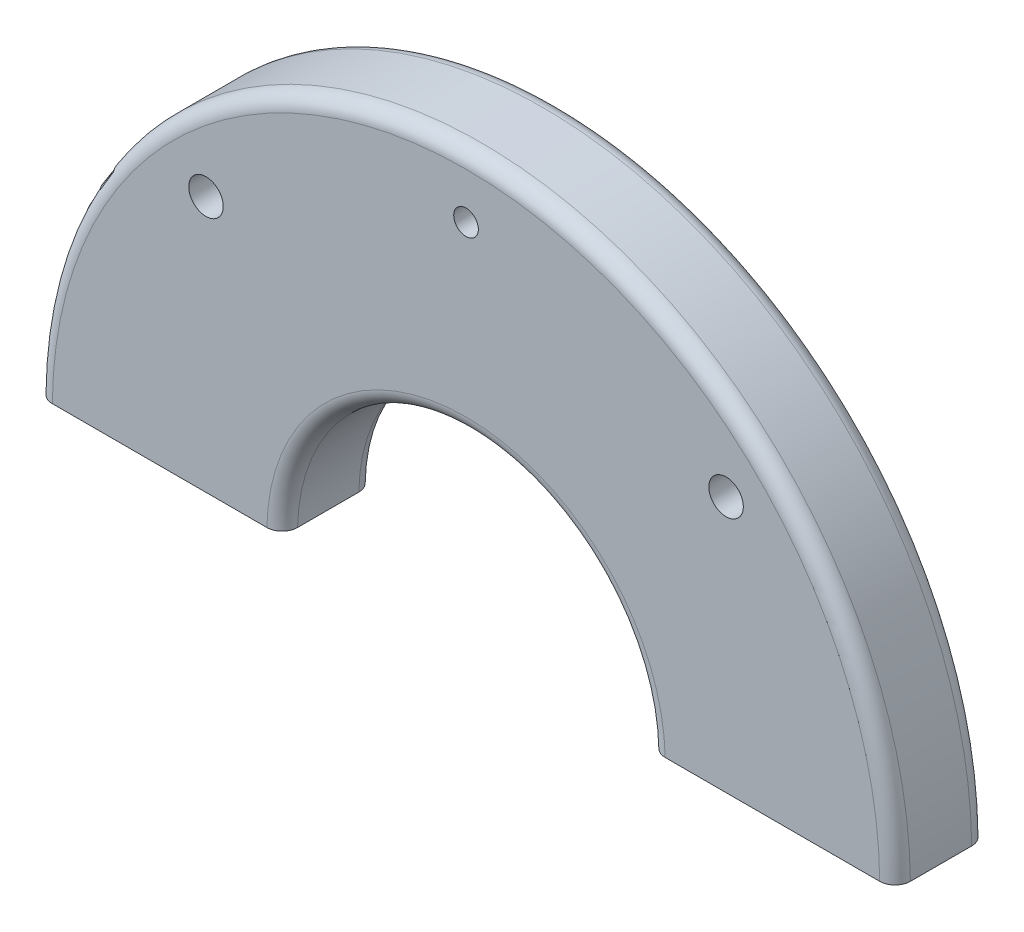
ISO-10303-21;
HEADER;
FILE_DESCRIPTION(('STEP AP214'),'2;1');
FILE_NAME('part.step','',(''),(''),'','','');
FILE_SCHEMA(('AUTOMOTIVE_DESIGN { 1 0 10303 214 1 1 1 1 }'));
ENDSEC;
DATA;
#1=APPLICATION_CONTEXT('core data for automotive mechanical design processes');
#2=APPLICATION_PROTOCOL_DEFINITION('international standard','automotive_design',2000,#1);
#3=PRODUCT_CONTEXT('',#1,'mechanical');
#4=PRODUCT('Part','Part','',(#3));
#5=PRODUCT_RELATED_PRODUCT_CATEGORY('part','',(#4));
#6=PRODUCT_DEFINITION_FORMATION('','',#4);
#7=PRODUCT_DEFINITION_CONTEXT('part definition',#1,'design');
#8=PRODUCT_DEFINITION('design','',#6,#7);
#9=PRODUCT_DEFINITION_SHAPE('','',#8);
#10=(LENGTH_UNIT() NAMED_UNIT(*) SI_UNIT(.MILLI.,.METRE.));
#11=(NAMED_UNIT(*) PLANE_ANGLE_UNIT() SI_UNIT($,.RADIAN.));
#12=(NAMED_UNIT(*) SI_UNIT($,.STERADIAN.) SOLID_ANGLE_UNIT());
#13=UNCERTAINTY_MEASURE_WITH_UNIT(LENGTH_MEASURE(1.E-05),#10,'distance_accuracy_value','');
#14=(GEOMETRIC_REPRESENTATION_CONTEXT(3) GLOBAL_UNCERTAINTY_ASSIGNED_CONTEXT((#13)) GLOBAL_UNIT_ASSIGNED_CONTEXT((#10,
#11,#12)) REPRESENTATION_CONTEXT('',''));
#15=CARTESIAN_POINT('',(0.,0.,0.));
#16=DIRECTION('',(0.,0.,1.));
#17=DIRECTION('',(1.,0.,0.));
#18=AXIS2_PLACEMENT_3D('',#15,#16,#17);
#19=CARTESIAN_POINT('',(0.,0.79375,-9.525));
#20=DIRECTION('',(0.,-1.,0.));
#21=DIRECTION('',(0.,0.,-1.));
#22=AXIS2_PLACEMENT_3D('',#19,#20,#21);
#23=PLANE('',#22);
#24=DIRECTION('',(0.,0.,1.));
#25=VECTOR('',#24,1.);
#26=CARTESIAN_POINT('',(-88.8964564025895,0.79375,-9.525));
#27=LINE('',#26,#25);
#28=CARTESIAN_POINT('',(-88.8964564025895,0.79375,-6.35));
#29=VERTEX_POINT('',#28);
#30=CARTESIAN_POINT('',(-88.8964564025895,0.79375,6.34999999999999));
#31=VERTEX_POINT('',#30);
#32=EDGE_CURVE('E161',#29,#31,#27,.T.);
#33=ORIENTED_EDGE('',*,*,#32,.F.);
#34=CARTESIAN_POINT('',(-88.8964564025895,0.79375,-6.35));
#35=CARTESIAN_POINT('',(-88.8964649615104,0.79375,-6.43929939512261));
#36=CARTESIAN_POINT('',(-88.8926888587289,0.79375,-6.52859473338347));
#37=CARTESIAN_POINT('',(-88.8776335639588,0.79375,-6.70654649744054));
#38=CARTESIAN_POINT('',(-88.8663547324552,0.79375,-6.79520295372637));
#39=CARTESIAN_POINT('',(-88.8363715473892,0.79375,-6.97118826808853));
#40=CARTESIAN_POINT('',(-88.8176728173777,0.79375,-7.05851807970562));
#41=CARTESIAN_POINT('',(-88.7730015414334,0.79375,-7.23127078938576));
#42=CARTESIAN_POINT('',(-88.7470290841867,0.79375,-7.31669371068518));
#43=CARTESIAN_POINT('',(-88.6584110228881,0.79375,-7.56927784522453));
#44=CARTESIAN_POINT('',(-88.5850524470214,0.79375,-7.73282613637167));
#45=CARTESIAN_POINT('',(-88.4119681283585,0.79375,-8.04516555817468));
#46=CARTESIAN_POINT('',(-88.3122470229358,0.79375,-8.19395927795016));
#47=CARTESIAN_POINT('',(-88.089233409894,0.79375,-8.47272103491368));
#48=CARTESIAN_POINT('',(-87.9659407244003,0.79375,-8.60268893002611));
#49=CARTESIAN_POINT('',(-87.6992599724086,0.79375,-8.84010139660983));
#50=CARTESIAN_POINT('',(-87.5558679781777,0.79375,-8.94754155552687));
#51=CARTESIAN_POINT('',(-87.2530617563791,0.79375,-9.13684472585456));
#52=CARTESIAN_POINT('',(-87.0936437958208,0.79375,-9.21870175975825));
#53=CARTESIAN_POINT('',(-86.7633597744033,0.79375,-9.35444826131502));
#54=CARTESIAN_POINT('',(-86.5925004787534,0.79375,-9.40835409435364));
#55=CARTESIAN_POINT('',(-86.304051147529,0.79375,-9.47327694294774));
#56=CARTESIAN_POINT('',(-86.1882751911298,0.79375,-9.49266137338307));
#57=CARTESIAN_POINT('',(-85.9554573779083,0.79375,-9.51852121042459));
#58=CARTESIAN_POINT('',(-85.8384175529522,0.79375,-9.5250149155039));
#59=CARTESIAN_POINT('',(-85.721325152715,0.79375,-9.525));
#60=B_SPLINE_CURVE_WITH_KNOTS('',3,(#34,#35,#36,#37,#38,#39,#40,#41,#42,#43,#44,#45,#46,#47,#48,
#49,#50,#51,#52,#53,#54,#55,#56,#57,#58,#59),.UNSPECIFIED.,.F.,.F.,(4,2,2,2,2,2,2,2,2,2,2,2,4),
(0.,0.267811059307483,0.535609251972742,0.803204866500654,1.0707972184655,1.60576641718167,
2.14064157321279,2.67552076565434,3.21050462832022,3.74561339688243,4.28040850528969,
4.63190272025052,4.9828976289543),.UNSPECIFIED.);
#61=CARTESIAN_POINT('',(-85.7213251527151,0.79375,-9.525));
#62=VERTEX_POINT('',#61);
#63=EDGE_CURVE('E276',#29,#62,#60,.T.);
#64=ORIENTED_EDGE('',*,*,#63,.T.);
#65=DIRECTION('',(1.,0.,0.));
#66=VECTOR('',#65,1.);
#67=CARTESIAN_POINT('',(0.,0.79375,-9.525));
#68=LINE('',#67,#66);
#69=CARTESIAN_POINT('',(-41.2673670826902,0.79375,-9.525));
#70=VERTEX_POINT('',#69);
#71=EDGE_CURVE('E171',#62,#70,#68,.T.);
#72=ORIENTED_EDGE('',*,*,#71,.T.);
#73=CARTESIAN_POINT('',(-41.2673670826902,0.79375,-9.525));
#74=CARTESIAN_POINT('',(-41.178034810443,0.79375,-9.52500854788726));
#75=CARTESIAN_POINT('',(-41.088706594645,0.79375,-9.52123122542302));
#76=CARTESIAN_POINT('',(-40.9106892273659,0.79375,-9.50617104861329));
#77=CARTESIAN_POINT('',(-40.82200004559,0.79375,-9.4948885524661));
#78=CARTESIAN_POINT('',(-40.6459491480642,0.79375,-9.46489548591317));
#79=CARTESIAN_POINT('',(-40.5585864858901,0.79375,-9.44619049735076));
#80=CARTESIAN_POINT('',(-40.3857687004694,0.79375,-9.40150406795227));
#81=CARTESIAN_POINT('',(-40.3003135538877,0.79375,-9.37552271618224));
#82=CARTESIAN_POINT('',(-40.0476337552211,0.79375,-9.28687371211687));
#83=CARTESIAN_POINT('',(-39.884023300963,0.79375,-9.21348887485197));
#84=CARTESIAN_POINT('',(-39.5715665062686,0.79375,-9.04033972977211));
#85=CARTESIAN_POINT('',(-39.4227175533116,0.79375,-8.94058010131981));
#86=CARTESIAN_POINT('',(-39.1438688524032,0.79375,-8.71748612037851));
#87=CARTESIAN_POINT('',(-39.0138675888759,0.79375,-8.59415366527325));
#88=CARTESIAN_POINT('',(-38.7764010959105,0.79375,-8.32738391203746));
#89=CARTESIAN_POINT('',(-38.6689402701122,0.79375,-8.1839426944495));
#90=CARTESIAN_POINT('',(-38.479635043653,0.79375,-7.88106404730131));
#91=CARTESIAN_POINT('',(-38.3977909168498,0.79375,-7.72162644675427));
#92=CARTESIAN_POINT('',(-38.262080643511,0.79375,-7.39130356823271));
#93=CARTESIAN_POINT('',(-38.2081980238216,0.79375,-7.22042509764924));
#94=CARTESIAN_POINT('',(-38.1433542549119,0.79375,-6.93208108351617));
#95=CARTESIAN_POINT('',(-38.124007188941,0.79375,-6.81643186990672));
#96=CARTESIAN_POINT('',(-38.0981972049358,0.79375,-6.58387129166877));
#97=CARTESIAN_POINT('',(-38.0917160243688,0.79375,-6.46696195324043));
#98=CARTESIAN_POINT('',(-38.0917308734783,0.79375,-6.35));
#99=B_SPLINE_CURVE_WITH_KNOTS('',3,(#73,#74,#75,#76,#77,#78,#79,#80,#81,#82,#83,#84,#85,#86,#87,
#88,#89,#90,#91,#92,#93,#94,#95,#96,#97,#98),.UNSPECIFIED.,.F.,.F.,(4,2,2,2,2,2,2,2,2,2,2,2,4),
(0.,0.267909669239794,0.535806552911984,0.803502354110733,1.07119487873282,1.60636521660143,
2.14144066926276,2.67647307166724,3.21160990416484,3.746752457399,4.2815793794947,
4.63268209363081,4.98328607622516),.UNSPECIFIED.);
#100=CARTESIAN_POINT('',(-38.0917308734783,0.79375,-6.35));
#101=VERTEX_POINT('',#100);
#102=EDGE_CURVE('E321',#70,#101,#99,.T.);
#103=ORIENTED_EDGE('',*,*,#102,.T.);
#104=DIRECTION('',(0.,0.,1.));
#105=VECTOR('',#104,1.);
#106=CARTESIAN_POINT('',(-38.0917308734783,0.79375,-9.525));
#107=LINE('',#106,#105);
#108=CARTESIAN_POINT('',(-38.0917308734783,0.79375,6.34999999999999));
#109=VERTEX_POINT('',#108);
#110=EDGE_CURVE('E181',#101,#109,#107,.T.);
#111=ORIENTED_EDGE('',*,*,#110,.T.);
#112=CARTESIAN_POINT('',(-38.0917308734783,0.79375,6.35));
#113=CARTESIAN_POINT('',(-38.0917223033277,0.79375,6.43928826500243));
#114=CARTESIAN_POINT('',(-38.095498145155,0.79375,6.52857246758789));
#115=CARTESIAN_POINT('',(-38.1105523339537,0.79375,6.7065019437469));
#116=CARTESIAN_POINT('',(-38.1218303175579,0.79375,6.79514724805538));
#117=CARTESIAN_POINT('',(-38.1518110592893,0.79375,6.97110984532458));
#118=CARTESIAN_POINT('',(-38.1705081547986,0.79375,7.05842809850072));
#119=CARTESIAN_POINT('',(-38.2151752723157,0.79375,7.23115785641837));
#120=CARTESIAN_POINT('',(-38.2411452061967,0.79375,7.31656938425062));
#121=CARTESIAN_POINT('',(-38.3297539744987,0.79375,7.56911941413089));
#122=CARTESIAN_POINT('',(-38.4031041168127,0.79375,7.73264540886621));
#123=CARTESIAN_POINT('',(-38.5761657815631,0.79375,8.04494359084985));
#124=CARTESIAN_POINT('',(-38.6758727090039,0.79375,8.19371834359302));
#125=CARTESIAN_POINT('',(-38.8988604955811,0.79375,8.47245994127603));
#126=CARTESIAN_POINT('',(-39.0221435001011,0.79375,8.60242507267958));
#127=CARTESIAN_POINT('',(-39.2888013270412,0.79375,8.8398377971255));
#128=CARTESIAN_POINT('',(-39.4321800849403,0.79375,8.94728096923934));
#129=CARTESIAN_POINT('',(-39.7349818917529,0.79375,9.13661445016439));
#130=CARTESIAN_POINT('',(-39.8944112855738,0.79375,9.21849460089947));
#131=CARTESIAN_POINT('',(-40.2247207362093,0.79375,9.35428917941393));
#132=CARTESIAN_POINT('',(-40.3955940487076,0.79375,9.40821991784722));
#133=CARTESIAN_POINT('',(-40.6841525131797,0.79375,9.47320461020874));
#134=CARTESIAN_POINT('',(-40.8000245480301,0.79375,9.49261610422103));
#135=CARTESIAN_POINT('',(-41.0330372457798,0.79375,9.51851212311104));
#136=CARTESIAN_POINT('',(-41.1501758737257,0.79375,9.52501496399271));
#137=CARTESIAN_POINT('',(-41.2673670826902,0.79375,9.525));
#138=B_SPLINE_CURVE_WITH_KNOTS('',3,(#112,#113,#114,#115,#116,#117,#118,#119,#120,#121,#122,
#123,#124,#125,#126,#127,#128,#129,#130,#131,#132,#133,#134,#135,#136,#137),.UNSPECIFIED.,.F.,
.F.,(4,2,2,2,2,2,2,2,2,2,2,2,4),(0.,0.267777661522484,0.53554235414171,0.803103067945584,
1.0706605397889,1.60555895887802,2.14036418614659,2.67521810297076,3.21017691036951,
3.7453480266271,4.28020647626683,4.63199696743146,4.98328794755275),.UNSPECIFIED.);
#139=CARTESIAN_POINT('',(-41.2673670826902,0.79375,9.525));
#140=VERTEX_POINT('',#139);
#141=EDGE_CURVE('E277',#109,#140,#138,.T.);
#142=ORIENTED_EDGE('',*,*,#141,.T.);
#143=DIRECTION('',(1.,0.,0.));
#144=VECTOR('',#143,1.);
#145=CARTESIAN_POINT('',(0.,0.79375,9.525));
#146=LINE('',#145,#144);
#147=CARTESIAN_POINT('',(-85.7213251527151,0.79375,9.525));
#148=VERTEX_POINT('',#147);
#149=EDGE_CURVE('E175',#148,#140,#146,.T.);
#150=ORIENTED_EDGE('',*,*,#149,.F.);
#151=CARTESIAN_POINT('',(-85.7213251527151,0.79375,9.525));
#152=CARTESIAN_POINT('',(-85.8106335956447,0.79375,9.52500855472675));
#153=CARTESIAN_POINT('',(-85.8999379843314,0.79375,9.52123216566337));
#154=CARTESIAN_POINT('',(-86.0779078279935,0.79375,9.50617569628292));
#155=CARTESIAN_POINT('',(-86.166573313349,0.79375,9.49489597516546));
#156=CARTESIAN_POINT('',(-86.3425768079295,0.79375,9.46491033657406));
#157=CARTESIAN_POINT('',(-86.429915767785,0.79375,9.44621002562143));
#158=CARTESIAN_POINT('',(-86.6026866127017,0.79375,9.40153485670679));
#159=CARTESIAN_POINT('',(-86.6881185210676,0.79375,9.37556008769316));
#160=CARTESIAN_POINT('',(-86.9407294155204,0.79375,9.28693383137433));
#161=CARTESIAN_POINT('',(-87.1042951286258,0.79375,9.21356813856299));
#162=CARTESIAN_POINT('',(-87.4166672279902,0.79375,9.0404657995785));
#163=CARTESIAN_POINT('',(-87.5654762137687,0.79375,8.94073380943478));
#164=CARTESIAN_POINT('',(-87.8442596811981,0.79375,8.71769847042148));
#165=CARTESIAN_POINT('',(-87.9742347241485,0.79375,8.59439582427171));
#166=CARTESIAN_POINT('',(-88.2116577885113,0.79375,8.32769255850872));
#167=CARTESIAN_POINT('',(-88.3191013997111,0.79375,8.18428801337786));
#168=CARTESIAN_POINT('',(-88.5083987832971,0.79375,7.88146629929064));
#169=CARTESIAN_POINT('',(-88.5902485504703,0.79375,7.72204662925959));
#170=CARTESIAN_POINT('',(-88.7259780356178,0.79375,7.39175980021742));
#171=CARTESIAN_POINT('',(-88.7798741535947,0.79375,7.22089941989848));
#172=CARTESIAN_POINT('',(-88.8447683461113,0.79375,6.93249396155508));
#173=CARTESIAN_POINT('',(-88.8641396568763,0.79375,6.81676362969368));
#174=CARTESIAN_POINT('',(-88.8899819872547,0.79375,6.5840383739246));
#175=CARTESIAN_POINT('',(-88.8964712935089,0.79375,6.46704548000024));
#176=CARTESIAN_POINT('',(-88.8964564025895,0.79375,6.35));
#177=B_SPLINE_CURVE_WITH_KNOTS('',3,(#151,#152,#153,#154,#155,#156,#157,#158,#159,#160,#161,
#162,#163,#164,#165,#166,#167,#168,#169,#170,#171,#172,#173,#174,#175,#176),.UNSPECIFIED.,.F.,
.F.,(4,2,2,2,2,2,2,2,2,2,2,2,4),(0.,0.267838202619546,0.535663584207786,0.80328699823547,
1.07090714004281,1.60593236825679,2.14086317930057,2.67577804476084,3.21079751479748,
3.74590066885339,4.28068952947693,4.63204294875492,4.98289724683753),.UNSPECIFIED.);
#178=EDGE_CURVE('E269',#148,#31,#177,.T.);
#179=ORIENTED_EDGE('',*,*,#178,.T.);
#180=EDGE_LOOP('',(#33,#64,#72,#103,#111,#142,#150,#179));
#181=FACE_BOUND('',#180,.T.);
#182=CARTESIAN_POINT('',(-76.2,0.793749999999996,0.));
#183=DIRECTION('',(0.,-1.,0.));
#184=DIRECTION('',(0.,0.,-1.));
#185=AXIS2_PLACEMENT_3D('',#182,#183,#184);
#186=CIRCLE('',#185,3.57123999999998);
#187=CARTESIAN_POINT('',(-76.2,0.793749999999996,-3.57123999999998));
#188=VERTEX_POINT('',#187);
#189=EDGE_CURVE('E129',#188,#188,#186,.F.);
#190=ORIENTED_EDGE('',*,*,#189,.T.);
#191=EDGE_LOOP('',(#190));
#192=FACE_BOUND('',#191,.T.);
#193=ADVANCED_FACE('F42',(#181,#192),#23,.T.);
#194=CARTESIAN_POINT('',(0.,0.,9.525));
#195=DIRECTION('',(0.,0.,1.));
#196=DIRECTION('',(1.,0.,0.));
#197=AXIS2_PLACEMENT_3D('',#194,#195,#196);
#198=PLANE('',#197);
#199=CARTESIAN_POINT('',(0.,76.2,9.525));
#200=DIRECTION('',(0.,0.,1.));
#201=DIRECTION('',(1.,0.,0.));
#202=AXIS2_PLACEMENT_3D('',#199,#200,#201);
#203=CIRCLE('',#202,2.5527);
#204=CARTESIAN_POINT('',(2.5527,76.2,9.525));
#205=VERTEX_POINT('',#204);
#206=EDGE_CURVE('E136',#205,#205,#203,.T.);
#207=ORIENTED_EDGE('',*,*,#206,.F.);
#208=EDGE_LOOP('',(#207));
#209=FACE_BOUND('',#208,.T.);
#210=CARTESIAN_POINT('',(-53.8815367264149,53.8815367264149,9.525));
#211=DIRECTION('',(0.,0.,1.));
#212=DIRECTION('',(1.,0.,0.));
#213=AXIS2_PLACEMENT_3D('',#210,#211,#212);
#214=CIRCLE('',#213,3.57124);
#215=CARTESIAN_POINT('',(-50.3102967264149,53.8815367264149,9.525));
#216=VERTEX_POINT('',#215);
#217=EDGE_CURVE('E152',#216,#216,#214,.T.);
#218=ORIENTED_EDGE('',*,*,#217,.F.);
#219=EDGE_LOOP('',(#218));
#220=FACE_BOUND('',#219,.T.);
#221=CARTESIAN_POINT('',(53.8815367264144,53.8815367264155,9.525));
#222=DIRECTION('',(0.,0.,1.));
#223=DIRECTION('',(1.,0.,0.));
#224=AXIS2_PLACEMENT_3D('',#221,#222,#223);
#225=CIRCLE('',#224,3.57124);
#226=CARTESIAN_POINT('',(57.4527767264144,53.8815367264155,9.525));
#227=VERTEX_POINT('',#226);
#228=EDGE_CURVE('E156',#227,#227,#225,.T.);
#229=ORIENTED_EDGE('',*,*,#228,.F.);
#230=EDGE_LOOP('',(#229));
#231=FACE_BOUND('',#230,.T.);
#232=DIRECTION('',(1.,0.,0.));
#233=VECTOR('',#232,1.);
#234=CARTESIAN_POINT('',(0.,0.79375,9.525));
#235=LINE('',#234,#233);
#236=CARTESIAN_POINT('',(41.2673670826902,0.79375,9.525));
#237=VERTEX_POINT('',#236);
#238=CARTESIAN_POINT('',(85.7213251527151,0.79375,9.525));
#239=VERTEX_POINT('',#238);
#240=EDGE_CURVE('E151',#237,#239,#235,.T.);
#241=ORIENTED_EDGE('',*,*,#240,.T.);
#242=CARTESIAN_POINT('',(0.,0.,9.525));
#243=DIRECTION('',(0.,0.,1.));
#244=DIRECTION('',(1.,0.,0.));
#245=AXIS2_PLACEMENT_3D('',#242,#243,#244);
#246=CIRCLE('',#245,85.725);
#247=EDGE_CURVE('E305',#239,#148,#246,.T.);
#248=ORIENTED_EDGE('',*,*,#247,.T.);
#249=ORIENTED_EDGE('',*,*,#149,.T.);
#250=CARTESIAN_POINT('',(0.,0.,9.525));
#251=DIRECTION('',(0.,0.,1.));
#252=DIRECTION('',(1.,0.,0.));
#253=AXIS2_PLACEMENT_3D('',#250,#251,#252);
#254=CIRCLE('',#253,41.275);
#255=EDGE_CURVE('E304',#140,#237,#254,.F.);
#256=ORIENTED_EDGE('',*,*,#255,.T.);
#257=EDGE_LOOP('',(#241,#248,#249,#256));
#258=FACE_BOUND('',#257,.T.);
#259=ADVANCED_FACE('F342',(#209,#220,#231,#258),#198,.T.);
#260=CARTESIAN_POINT('',(0.,0.,-9.525));
#261=DIRECTION('',(0.,0.,1.));
#262=DIRECTION('',(1.,0.,0.));
#263=AXIS2_PLACEMENT_3D('',#260,#261,#262);
#264=PLANE('',#263);
#265=CARTESIAN_POINT('',(0.,76.2,-9.525));
#266=DIRECTION('',(0.,0.,-1.));
#267=DIRECTION('',(-1.,0.,0.));
#268=AXIS2_PLACEMENT_3D('',#265,#266,#267);
#269=CIRCLE('',#268,2.5527);
#270=CARTESIAN_POINT('',(-2.5527,76.2,-9.525));
#271=VERTEX_POINT('',#270);
#272=EDGE_CURVE('E330',#271,#271,#269,.T.);
#273=ORIENTED_EDGE('',*,*,#272,.F.);
#274=EDGE_LOOP('',(#273));
#275=FACE_BOUND('',#274,.T.);
#276=CARTESIAN_POINT('',(-53.8815367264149,53.8815367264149,-9.525));
#277=DIRECTION('',(0.,0.,1.));
#278=DIRECTION('',(1.,0.,0.));
#279=AXIS2_PLACEMENT_3D('',#276,#277,#278);
#280=CIRCLE('',#279,3.57124);
#281=CARTESIAN_POINT('',(-50.3102967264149,53.8815367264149,-9.525));
#282=VERTEX_POINT('',#281);
#283=EDGE_CURVE('E146',#282,#282,#280,.T.);
#284=ORIENTED_EDGE('',*,*,#283,.T.);
#285=EDGE_LOOP('',(#284));
#286=FACE_BOUND('',#285,.T.);
#287=CARTESIAN_POINT('',(53.8815367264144,53.8815367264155,-9.525));
#288=DIRECTION('',(0.,0.,1.));
#289=DIRECTION('',(1.,0.,0.));
#290=AXIS2_PLACEMENT_3D('',#287,#288,#289);
#291=CIRCLE('',#290,3.57124);
#292=CARTESIAN_POINT('',(57.4527767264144,53.8815367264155,-9.525));
#293=VERTEX_POINT('',#292);
#294=EDGE_CURVE('E150',#293,#293,#291,.T.);
#295=ORIENTED_EDGE('',*,*,#294,.T.);
#296=EDGE_LOOP('',(#295));
#297=FACE_BOUND('',#296,.T.);
#298=ORIENTED_EDGE('',*,*,#71,.F.);
#299=CARTESIAN_POINT('',(0.,0.,-9.525));
#300=DIRECTION('',(0.,0.,1.));
#301=DIRECTION('',(1.,0.,0.));
#302=AXIS2_PLACEMENT_3D('',#299,#300,#301);
#303=CIRCLE('',#302,85.725);
#304=CARTESIAN_POINT('',(85.7213251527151,0.79375,-9.525));
#305=VERTEX_POINT('',#304);
#306=EDGE_CURVE('E291',#62,#305,#303,.F.);
#307=ORIENTED_EDGE('',*,*,#306,.T.);
#308=DIRECTION('',(1.,0.,0.));
#309=VECTOR('',#308,1.);
#310=CARTESIAN_POINT('',(0.,0.79375,-9.525));
#311=LINE('',#310,#309);
#312=CARTESIAN_POINT('',(41.2673670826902,0.79375,-9.525));
#313=VERTEX_POINT('',#312);
#314=EDGE_CURVE('E165',#313,#305,#311,.T.);
#315=ORIENTED_EDGE('',*,*,#314,.F.);
#316=CARTESIAN_POINT('',(0.,0.,-9.525));
#317=DIRECTION('',(0.,0.,1.));
#318=DIRECTION('',(1.,0.,0.));
#319=AXIS2_PLACEMENT_3D('',#316,#317,#318);
#320=CIRCLE('',#319,41.275);
#321=EDGE_CURVE('E288',#313,#70,#320,.T.);
#322=ORIENTED_EDGE('',*,*,#321,.T.);
#323=EDGE_LOOP('',(#298,#307,#315,#322));
#324=FACE_BOUND('',#323,.T.);
#325=ADVANCED_FACE('F339',(#275,#286,#297,#324),#264,.F.);
#326=CARTESIAN_POINT('',(0.,0.,9.525));
#327=DIRECTION('',(0.,0.,-1.));
#328=DIRECTION('',(-1.,0.,0.));
#329=AXIS2_PLACEMENT_3D('',#326,#327,#328);
#330=CYLINDRICAL_SURFACE('',#329,88.9);
#331=CARTESIAN_POINT('',(-76.2,45.7905011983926,5.55624999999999));
#332=CARTESIAN_POINT('',(-76.3565031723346,45.5300642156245,5.55624993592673));
#333=CARTESIAN_POINT('',(-76.5116679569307,45.2688283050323,5.54964535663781));
#334=CARTESIAN_POINT('',(-76.8190327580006,44.7452606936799,5.52381175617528));
#335=CARTESIAN_POINT('',(-76.9712328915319,44.4829290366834,5.50458323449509));
#336=CARTESIAN_POINT('',(-77.2725662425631,43.9573922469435,5.45388659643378));
#337=CARTESIAN_POINT('',(-77.421696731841,43.694186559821,5.42240804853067));
#338=CARTESIAN_POINT('',(-77.716545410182,43.1675761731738,5.34744274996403));
#339=CARTESIAN_POINT('',(-77.8622636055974,42.9041714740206,5.30395602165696));
#340=CARTESIAN_POINT('',(-78.1504187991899,42.3770276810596,5.20490605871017));
#341=CARTESIAN_POINT('',(-78.2928474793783,42.1132892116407,5.14931527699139));
#342=CARTESIAN_POINT('',(-78.573875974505,41.5865977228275,5.0259507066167));
#343=CARTESIAN_POINT('',(-78.7124755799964,41.323644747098,4.95817625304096));
#344=CARTESIAN_POINT('',(-78.9854761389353,40.7994094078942,4.81010731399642));
#345=CARTESIAN_POINT('',(-79.1198809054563,40.5381257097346,4.7298246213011));
#346=CARTESIAN_POINT('',(-79.3843175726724,40.0178117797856,4.5559934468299));
#347=CARTESIAN_POINT('',(-79.514350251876,39.7587811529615,4.46244734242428));
#348=CARTESIAN_POINT('',(-79.7656421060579,39.2521302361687,4.26414347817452));
#349=CARTESIAN_POINT('',(-79.8870487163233,39.0044083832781,4.15983460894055));
#350=CARTESIAN_POINT('',(-80.124962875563,38.5133066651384,3.9361480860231));
#351=CARTESIAN_POINT('',(-80.2414688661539,38.2699281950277,3.81676568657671));
#352=CARTESIAN_POINT('',(-80.468184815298,37.7908844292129,3.5613988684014));
#353=CARTESIAN_POINT('',(-80.5784259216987,37.5551840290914,3.42550952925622));
#354=CARTESIAN_POINT('',(-80.73856640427,37.2090056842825,3.20647195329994));
#355=CARTESIAN_POINT('',(-80.7910579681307,37.0948823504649,3.13095615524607));
#356=CARTESIAN_POINT('',(-80.8940793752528,36.8696791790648,2.974277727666));
#357=CARTESIAN_POINT('',(-80.9446094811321,36.7585989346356,2.89311585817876));
#358=CARTESIAN_POINT('',(-81.0618487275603,36.4995027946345,2.69302461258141));
#359=CARTESIAN_POINT('',(-81.1275623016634,36.3531646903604,2.57130007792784));
#360=CARTESIAN_POINT('',(-81.2536674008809,36.0704242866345,2.3136472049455));
#361=CARTESIAN_POINT('',(-81.3140504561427,35.9340378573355,2.17769698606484));
#362=CARTESIAN_POINT('',(-81.428047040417,35.6749678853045,1.88785082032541));
#363=CARTESIAN_POINT('',(-81.4815890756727,35.5524303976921,1.7337933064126));
#364=CARTESIAN_POINT('',(-81.5779527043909,35.3307540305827,1.40656117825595));
#365=CARTESIAN_POINT('',(-81.6208045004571,35.2315492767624,1.23344246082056));
#366=CARTESIAN_POINT('',(-81.6790084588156,35.0963395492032,0.931241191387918));
#367=CARTESIAN_POINT('',(-81.6987486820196,35.0503356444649,0.80753027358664));
#368=CARTESIAN_POINT('',(-81.7300701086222,34.9772388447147,0.553650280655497));
#369=CARTESIAN_POINT('',(-81.741662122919,34.9501208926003,0.423490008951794));
#370=CARTESIAN_POINT('',(-81.7555574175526,34.9176055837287,0.159069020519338));
#371=CARTESIAN_POINT('',(-81.7578016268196,34.9123463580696,0.0247876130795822));
#372=CARTESIAN_POINT('',(-81.7525643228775,34.9246082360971,-0.242559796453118));
#373=CARTESIAN_POINT('',(-81.7450789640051,34.9421383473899,-0.375625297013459));
#374=CARTESIAN_POINT('',(-81.7220954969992,34.9958547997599,-0.627063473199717));
#375=CARTESIAN_POINT('',(-81.7072068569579,35.0306215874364,-0.745807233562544));
#376=CARTESIAN_POINT('',(-81.6709723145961,35.1150166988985,-0.976760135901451));
#377=CARTESIAN_POINT('',(-81.6496238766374,35.1646508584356,-1.08896669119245));
#378=CARTESIAN_POINT('',(-81.5842211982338,35.3162233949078,-1.3853162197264));
#379=CARTESIAN_POINT('',(-81.534960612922,35.4299121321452,-1.56226151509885));
#380=CARTESIAN_POINT('',(-81.4258217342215,35.6800268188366,-1.89570518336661));
#381=CARTESIAN_POINT('',(-81.3659055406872,35.8165338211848,-2.05212698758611));
#382=CARTESIAN_POINT('',(-81.2411190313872,36.0986634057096,-2.34154454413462));
#383=CARTESIAN_POINT('',(-81.1765275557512,36.2437341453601,-2.47520950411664));
#384=CARTESIAN_POINT('',(-81.0421246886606,36.543276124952,-2.72880090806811));
#385=CARTESIAN_POINT('',(-80.9723083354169,36.6977562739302,-2.84871401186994));
#386=CARTESIAN_POINT('',(-80.8284221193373,37.0135971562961,-3.0769862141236));
#387=CARTESIAN_POINT('',(-80.7543440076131,37.1749710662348,-3.1853216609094));
#388=CARTESIAN_POINT('',(-80.602773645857,37.5024725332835,-3.39173692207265));
#389=CARTESIAN_POINT('',(-80.5252824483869,37.6685986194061,-3.48981986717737));
#390=CARTESIAN_POINT('',(-80.360147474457,38.0197011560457,-3.68550305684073));
#391=CARTESIAN_POINT('',(-80.2722210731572,38.2050185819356,-3.78224921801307));
#392=CARTESIAN_POINT('',(-80.0932309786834,38.5788455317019,-3.96624933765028));
#393=CARTESIAN_POINT('',(-80.0021667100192,38.7673556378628,-4.0535015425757));
#394=CARTESIAN_POINT('',(-79.8171286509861,39.146910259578,-4.21944911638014));
#395=CARTESIAN_POINT('',(-79.7231525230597,39.3379567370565,-4.29813736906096));
#396=CARTESIAN_POINT('',(-79.5325703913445,39.7218606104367,-4.44753124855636));
#397=CARTESIAN_POINT('',(-79.4359640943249,39.914718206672,-4.51823598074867));
#398=CARTESIAN_POINT('',(-79.1421703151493,40.4958681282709,-4.71932595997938));
#399=CARTESIAN_POINT('',(-78.9412629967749,40.8862137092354,-4.83846206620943));
#400=CARTESIAN_POINT('',(-78.5305347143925,41.6696638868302,-5.04913239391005));
#401=CARTESIAN_POINT('',(-78.3207122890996,42.0627689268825,-5.14066207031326));
#402=CARTESIAN_POINT('',(-77.9872304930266,42.6762771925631,-5.26249943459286));
#403=CARTESIAN_POINT('',(-77.8663679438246,42.8964111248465,-5.30200755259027));
#404=CARTESIAN_POINT('',(-77.6222306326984,43.3366203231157,-5.372645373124));
#405=CARTESIAN_POINT('',(-77.4989563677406,43.5566955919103,-5.40377678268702));
#406=CARTESIAN_POINT('',(-77.1255497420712,44.216682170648,-5.48454386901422));
#407=CARTESIAN_POINT('',(-76.871898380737,44.6562349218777,-5.52152870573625));
#408=CARTESIAN_POINT('',(-76.3570813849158,45.530902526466,-5.56000770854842));
#409=CARTESIAN_POINT('',(-76.0959373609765,45.9660260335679,-5.56159533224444));
#410=CARTESIAN_POINT('',(-75.5669748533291,46.8305313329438,-5.52643234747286));
#411=CARTESIAN_POINT('',(-75.2991600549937,47.2599161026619,-5.48970246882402));
#412=CARTESIAN_POINT('',(-74.8761205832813,47.9255473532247,-5.39848927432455));
#413=CARTESIAN_POINT('',(-74.7224237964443,48.1648173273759,-5.35860748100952));
#414=CARTESIAN_POINT('',(-74.4141308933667,48.6397696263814,-5.26389603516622));
#415=CARTESIAN_POINT('',(-74.2595349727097,48.8754526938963,-5.20906952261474));
#416=CARTESIAN_POINT('',(-73.9500567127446,49.3424526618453,-5.08306992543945));
#417=CARTESIAN_POINT('',(-73.7951742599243,49.5737669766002,-5.01188746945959));
#418=CARTESIAN_POINT('',(-73.4861989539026,50.0306360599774,-4.85154581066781));
#419=CARTESIAN_POINT('',(-73.3321059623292,50.25619186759,-4.76238987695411));
#420=CARTESIAN_POINT('',(-73.0557541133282,50.6568258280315,-4.58336252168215));
#421=CARTESIAN_POINT('',(-72.9331207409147,50.8332051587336,-4.49698773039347));
#422=CARTESIAN_POINT('',(-72.6901592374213,51.1800308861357,-4.31003912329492));
#423=CARTESIAN_POINT('',(-72.569831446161,51.3504764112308,-4.20946323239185));
#424=CARTESIAN_POINT('',(-72.3329916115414,51.6835561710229,-3.99297507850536));
#425=CARTESIAN_POINT('',(-72.2164724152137,51.8462053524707,-3.87709390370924));
#426=CARTESIAN_POINT('',(-71.9887547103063,52.1619312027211,-3.62846095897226));
#427=CARTESIAN_POINT('',(-71.8775529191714,52.31501379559,-3.49571978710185));
#428=CARTESIAN_POINT('',(-71.6421061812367,52.6371115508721,-3.18472626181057));
#429=CARTESIAN_POINT('',(-71.5194112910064,52.8036075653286,-3.00262110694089));
#430=CARTESIAN_POINT('',(-71.2899100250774,53.1130471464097,-2.61044746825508));
#431=CARTESIAN_POINT('',(-71.1830844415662,53.2560192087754,-2.40041338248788));
#432=CARTESIAN_POINT('',(-71.0103840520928,53.4859986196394,-1.99464877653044));
#433=CARTESIAN_POINT('',(-70.9405850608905,53.5784777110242,-1.80377248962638));
#434=CARTESIAN_POINT('',(-70.85052381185,53.697446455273,-1.50527698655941));
#435=CARTESIAN_POINT('',(-70.82293823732,53.7338171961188,-1.40372334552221));
#436=CARTESIAN_POINT('',(-70.7731880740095,53.7993265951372,-1.19703992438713));
#437=CARTESIAN_POINT('',(-70.751020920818,53.8284686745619,-1.09191186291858));
#438=CARTESIAN_POINT('',(-70.712428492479,53.8791563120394,-0.87773747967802));
#439=CARTESIAN_POINT('',(-70.6960582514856,53.9006290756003,-0.768663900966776));
#440=CARTESIAN_POINT('',(-70.6697684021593,53.9350934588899,-0.548406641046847));
#441=CARTESIAN_POINT('',(-70.6598487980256,53.9480850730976,-0.437222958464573));
#442=CARTESIAN_POINT('',(-70.6467401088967,53.9652502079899,-0.213842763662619));
#443=CARTESIAN_POINT('',(-70.6435471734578,53.9694287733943,-0.101646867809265));
#444=CARTESIAN_POINT('',(-70.6439727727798,53.9688716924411,0.122701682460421));
#445=CARTESIAN_POINT('',(-70.6475905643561,53.9641370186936,0.234854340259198));
#446=CARTESIAN_POINT('',(-70.6605598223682,53.9471535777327,0.442470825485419));
#447=CARTESIAN_POINT('',(-70.6690431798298,53.936042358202,0.538084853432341));
#448=CARTESIAN_POINT('',(-70.6907975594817,53.9075268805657,0.727829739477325));
#449=CARTESIAN_POINT('',(-70.7040700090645,53.8901207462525,0.821960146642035));
#450=CARTESIAN_POINT('',(-70.7507044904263,53.8289002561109,1.1011904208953));
#451=CARTESIAN_POINT('',(-70.7908919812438,53.7760729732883,1.28325500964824));
#452=CARTESIAN_POINT('',(-70.9010339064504,53.6308105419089,1.68790256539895));
#453=CARTESIAN_POINT('',(-70.9762848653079,53.5312708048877,1.9064523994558));
#454=CARTESIAN_POINT('',(-71.1464973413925,53.3048409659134,2.32042013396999));
#455=CARTESIAN_POINT('',(-71.2414942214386,53.1779017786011,2.51579553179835));
#456=CARTESIAN_POINT('',(-71.4920370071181,52.8408922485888,2.96655844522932));
#457=CARTESIAN_POINT('',(-71.6554844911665,52.6192536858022,3.20888814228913));
#458=CARTESIAN_POINT('',(-71.9136092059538,52.2653290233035,3.53811715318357));
#459=CARTESIAN_POINT('',(-72.0019506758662,52.1435793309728,3.64227843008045));
#460=CARTESIAN_POINT('',(-72.1819914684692,51.8940620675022,3.83997053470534));
#461=CARTESIAN_POINT('',(-72.2736901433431,51.7662956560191,3.93350339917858));
#462=CARTESIAN_POINT('',(-72.5192834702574,51.4221014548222,4.16758686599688));
#463=CARTESIAN_POINT('',(-72.6752809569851,51.2014573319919,4.29972976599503));
#464=CARTESIAN_POINT('',(-72.991130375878,50.7501812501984,4.54031773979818));
#465=CARTESIAN_POINT('',(-73.1509848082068,50.5195427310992,4.64874695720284));
#466=CARTESIAN_POINT('',(-73.4726864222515,50.0505275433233,4.84449707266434));
#467=CARTESIAN_POINT('',(-73.6345353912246,49.8121435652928,4.9317973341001));
#468=CARTESIAN_POINT('',(-73.9586430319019,49.3296421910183,5.0872905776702));
#469=CARTESIAN_POINT('',(-74.12090160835,49.0855260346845,5.15548765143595));
#470=CARTESIAN_POINT('',(-74.4455091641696,48.5918080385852,5.27481676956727));
#471=CARTESIAN_POINT('',(-74.6078559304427,48.342188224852,5.32587977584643));
#472=CARTESIAN_POINT('',(-74.9312438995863,47.8393984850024,5.41203931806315));
#473=CARTESIAN_POINT('',(-75.0922850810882,47.5862285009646,5.44713559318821));
#474=CARTESIAN_POINT('',(-75.4124641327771,47.0771776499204,5.50255302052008));
#475=CARTESIAN_POINT('',(-75.571602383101,46.8212973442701,5.52287717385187));
#476=CARTESIAN_POINT('',(-75.8876013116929,46.3073750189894,5.54972679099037));
#477=CARTESIAN_POINT('',(-76.0444616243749,46.0493326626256,5.55625006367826));
#478=CARTESIAN_POINT('',(-76.2,45.7905011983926,5.55624999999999));
#479=B_SPLINE_CURVE_WITH_KNOTS('',3,(#331,#332,#333,#334,#335,#336,#337,#338,#339,#340,#341,
#342,#343,#344,#345,#346,#347,#348,#349,#350,#351,#352,#353,#354,#355,#356,#357,#358,#359,#360,
#361,#362,#363,#364,#365,#366,#367,#368,#369,#370,#371,#372,#373,#374,#375,#376,#377,#378,#379,
#380,#381,#382,#383,#384,#385,#386,#387,#388,#389,#390,#391,#392,#393,#394,#395,#396,#397,#398,
#399,#400,#401,#402,#403,#404,#405,#406,#407,#408,#409,#410,#411,#412,#413,#414,#415,#416,#417,
#418,#419,#420,#421,#422,#423,#424,#425,#426,#427,#428,#429,#430,#431,#432,#433,#434,#435,#436,
#437,#438,#439,#440,#441,#442,#443,#444,#445,#446,#447,#448,#449,#450,#451,#452,#453,#454,#455,
#456,#457,#458,#459,#460,#461,#462,#463,#464,#465,#466,#467,#468,#469,#470,#471,#472,#473,#474,
#475,#476,#477,#478),.UNSPECIFIED.,.T.,.F.,(4,2,2,2,2,2,2,2,2,2,2,2,2,2,2,2,2,2,2,2,2,2,2,2,2,2,
2,2,2,2,2,2,2,2,2,2,2,2,2,2,2,2,2,2,2,2,2,2,2,2,2,2,2,2,2,2,2,2,2,2,2,2,2,2,2,2,2,2,2,2,2,2,2,
4),(0.,0.911453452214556,1.8228708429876,2.73506605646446,3.64725957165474,4.56155122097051,
5.47589278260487,6.38937746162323,7.30269861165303,8.18709531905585,9.07177116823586,
9.95157353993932,10.3911505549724,10.8306685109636,11.4341295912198,12.0385328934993,
12.6488101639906,13.2573432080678,13.6562663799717,14.0546592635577,14.4555659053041,
14.8566310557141,15.2290955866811,15.6017065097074,16.245983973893,16.8926006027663,
17.5143701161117,18.1367377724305,18.7603534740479,19.3837781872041,20.063864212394,
20.7440756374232,21.4248480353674,22.1056966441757,23.4692631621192,24.8330540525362,
25.595575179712,26.3579408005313,27.8830847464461,29.4042014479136,30.9244956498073,
31.785648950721,32.6466214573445,33.5080885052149,34.3693990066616,35.0635578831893,
35.7578182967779,36.4506896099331,37.1431275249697,37.9674568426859,38.7907801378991,
39.457801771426,39.7914673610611,40.1249747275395,40.4615683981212,40.7981622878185,
41.1345634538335,41.4709279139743,41.7604763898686,42.0501112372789,42.6290063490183,
43.3798962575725,44.1321426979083,45.2261224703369,45.7747456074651,46.323263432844,
47.2242462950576,48.1258297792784,49.0282903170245,49.9305574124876,50.8364175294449,
51.7422924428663,52.6479832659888,53.5538178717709),.UNSPECIFIED.);
#480=CARTESIAN_POINT('',(-76.2,45.7905011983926,5.55624999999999));
#481=VERTEX_POINT('',#480);
#482=EDGE_CURVE('E144',#481,#481,#479,.T.);
#483=ORIENTED_EDGE('',*,*,#482,.T.);
#484=EDGE_LOOP('',(#483));
#485=FACE_BOUND('',#484,.T.);
#486=DIRECTION('',(0.,0.,1.));
#487=VECTOR('',#486,1.);
#488=CARTESIAN_POINT('',(88.8964564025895,0.79375,-9.525));
#489=LINE('',#488,#487);
#490=CARTESIAN_POINT('',(88.8964564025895,0.79375,-6.35));
#491=VERTEX_POINT('',#490);
#492=CARTESIAN_POINT('',(88.8964564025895,0.79375,6.34999999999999));
#493=VERTEX_POINT('',#492);
#494=EDGE_CURVE('E168',#491,#493,#489,.T.);
#495=ORIENTED_EDGE('',*,*,#494,.F.);
#496=CARTESIAN_POINT('',(0.,0.,-6.35));
#497=DIRECTION('',(0.,0.,1.));
#498=DIRECTION('',(1.,0.,0.));
#499=AXIS2_PLACEMENT_3D('',#496,#497,#498);
#500=CIRCLE('',#499,88.9);
#501=EDGE_CURVE('E318',#491,#29,#500,.T.);
#502=ORIENTED_EDGE('',*,*,#501,.T.);
#503=ORIENTED_EDGE('',*,*,#32,.T.);
#504=CARTESIAN_POINT('',(0.,0.,6.35));
#505=DIRECTION('',(0.,0.,1.));
#506=DIRECTION('',(1.,0.,0.));
#507=AXIS2_PLACEMENT_3D('',#504,#505,#506);
#508=CIRCLE('',#507,88.9);
#509=EDGE_CURVE('E185',#31,#493,#508,.F.);
#510=ORIENTED_EDGE('',*,*,#509,.T.);
#511=EDGE_LOOP('',(#495,#502,#503,#510));
#512=FACE_BOUND('',#511,.T.);
#513=ADVANCED_FACE('F201',(#485,#512),#330,.T.);
#514=CARTESIAN_POINT('',(0.,0.,9.525));
#515=DIRECTION('',(0.,0.,-1.));
#516=DIRECTION('',(-1.,0.,0.));
#517=AXIS2_PLACEMENT_3D('',#514,#515,#516);
#518=CYLINDRICAL_SURFACE('',#517,38.1);
#519=DIRECTION('',(0.,0.,1.));
#520=VECTOR('',#519,1.);
#521=CARTESIAN_POINT('',(38.0917308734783,0.79375,-9.525));
#522=LINE('',#521,#520);
#523=CARTESIAN_POINT('',(38.0917308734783,0.79375,-6.35));
#524=VERTEX_POINT('',#523);
#525=CARTESIAN_POINT('',(38.0917308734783,0.79375,6.34999999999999));
#526=VERTEX_POINT('',#525);
#527=EDGE_CURVE('E157',#524,#526,#522,.T.);
#528=ORIENTED_EDGE('',*,*,#527,.T.);
#529=CARTESIAN_POINT('',(0.,0.,6.35));
#530=DIRECTION('',(0.,0.,1.));
#531=DIRECTION('',(1.,0.,0.));
#532=AXIS2_PLACEMENT_3D('',#529,#530,#531);
#533=CIRCLE('',#532,38.1);
#534=EDGE_CURVE('E11',#526,#109,#533,.T.);
#535=ORIENTED_EDGE('',*,*,#534,.T.);
#536=ORIENTED_EDGE('',*,*,#110,.F.);
#537=CARTESIAN_POINT('',(0.,0.,-6.35));
#538=DIRECTION('',(0.,0.,1.));
#539=DIRECTION('',(1.,0.,0.));
#540=AXIS2_PLACEMENT_3D('',#537,#538,#539);
#541=CIRCLE('',#540,38.1);
#542=EDGE_CURVE('E52',#101,#524,#541,.F.);
#543=ORIENTED_EDGE('',*,*,#542,.T.);
#544=EDGE_LOOP('',(#528,#535,#536,#543));
#545=FACE_BOUND('',#544,.T.);
#546=ADVANCED_FACE('F218',(#545),#518,.F.);
#547=CARTESIAN_POINT('',(-53.8815367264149,53.8815367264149,9.525));
#548=DIRECTION('',(0.,0.,1.));
#549=DIRECTION('',(1.,0.,0.));
#550=AXIS2_PLACEMENT_3D('',#547,#548,#549);
#551=CYLINDRICAL_SURFACE('',#550,3.57124);
#552=ORIENTED_EDGE('',*,*,#283,.F.);
#553=EDGE_LOOP('',(#552));
#554=FACE_BOUND('',#553,.T.);
#555=ORIENTED_EDGE('',*,*,#217,.T.);
#556=EDGE_LOOP('',(#555));
#557=FACE_BOUND('',#556,.T.);
#558=ADVANCED_FACE('F214',(#554,#557),#551,.F.);
#559=CARTESIAN_POINT('',(53.8815367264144,53.8815367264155,9.525));
#560=DIRECTION('',(0.,0.,1.));
#561=DIRECTION('',(1.,0.,0.));
#562=AXIS2_PLACEMENT_3D('',#559,#560,#561);
#563=CYLINDRICAL_SURFACE('',#562,3.57124);
#564=ORIENTED_EDGE('',*,*,#294,.F.);
#565=EDGE_LOOP('',(#564));
#566=FACE_BOUND('',#565,.T.);
#567=ORIENTED_EDGE('',*,*,#228,.T.);
#568=EDGE_LOOP('',(#567));
#569=FACE_BOUND('',#568,.T.);
#570=ADVANCED_FACE('F217',(#566,#569),#563,.F.);
#571=CARTESIAN_POINT('',(0.,0.79375,-9.525));
#572=DIRECTION('',(0.,-1.,0.));
#573=DIRECTION('',(0.,0.,-1.));
#574=AXIS2_PLACEMENT_3D('',#571,#572,#573);
#575=PLANE('',#574);
#576=CARTESIAN_POINT('',(76.2,0.79375,0.));
#577=DIRECTION('',(0.,-1.,0.));
#578=DIRECTION('',(0.,0.,-1.));
#579=AXIS2_PLACEMENT_3D('',#576,#577,#578);
#580=CIRCLE('',#579,2.55270000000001);
#581=CARTESIAN_POINT('',(76.2,0.79375,-2.55270000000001));
#582=VERTEX_POINT('',#581);
#583=EDGE_CURVE('E130',#582,#582,#580,.T.);
#584=ORIENTED_EDGE('',*,*,#583,.F.);
#585=EDGE_LOOP('',(#584));
#586=FACE_BOUND('',#585,.T.);
#587=ORIENTED_EDGE('',*,*,#314,.T.);
#588=CARTESIAN_POINT('',(85.7213251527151,0.79375,-9.525));
#589=CARTESIAN_POINT('',(85.8106335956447,0.79375,-9.52500855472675));
#590=CARTESIAN_POINT('',(85.8999379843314,0.79375,-9.52123216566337));
#591=CARTESIAN_POINT('',(86.0779078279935,0.79375,-9.50617569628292));
#592=CARTESIAN_POINT('',(86.166573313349,0.79375,-9.49489597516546));
#593=CARTESIAN_POINT('',(86.3425768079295,0.79375,-9.46491033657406));
#594=CARTESIAN_POINT('',(86.429915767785,0.79375,-9.44621002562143));
#595=CARTESIAN_POINT('',(86.6026866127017,0.79375,-9.40153485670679));
#596=CARTESIAN_POINT('',(86.6881185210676,0.79375,-9.37556008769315));
#597=CARTESIAN_POINT('',(86.9407294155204,0.79375,-9.28693383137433));
#598=CARTESIAN_POINT('',(87.1042951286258,0.79375,-9.21356813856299));
#599=CARTESIAN_POINT('',(87.4166672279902,0.79375,-9.0404657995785));
#600=CARTESIAN_POINT('',(87.5654762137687,0.79375,-8.94073380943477));
#601=CARTESIAN_POINT('',(87.8442596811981,0.79375,-8.71769847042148));
#602=CARTESIAN_POINT('',(87.9742347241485,0.79375,-8.59439582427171));
#603=CARTESIAN_POINT('',(88.2116577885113,0.79375,-8.32769255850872));
#604=CARTESIAN_POINT('',(88.3191013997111,0.79375,-8.18428801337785));
#605=CARTESIAN_POINT('',(88.5083987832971,0.79375,-7.88146629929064));
#606=CARTESIAN_POINT('',(88.5902485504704,0.79375,-7.7220466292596));
#607=CARTESIAN_POINT('',(88.7259780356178,0.79375,-7.39175980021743));
#608=CARTESIAN_POINT('',(88.7798741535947,0.79375,-7.22089941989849));
#609=CARTESIAN_POINT('',(88.8447683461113,0.79375,-6.93249396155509));
#610=CARTESIAN_POINT('',(88.8641396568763,0.79375,-6.81676362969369));
#611=CARTESIAN_POINT('',(88.8899819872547,0.79375,-6.58403837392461));
#612=CARTESIAN_POINT('',(88.8964712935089,0.79375,-6.46704548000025));
#613=CARTESIAN_POINT('',(88.8964564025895,0.79375,-6.35));
#614=B_SPLINE_CURVE_WITH_KNOTS('',3,(#588,#589,#590,#591,#592,#593,#594,#595,#596,#597,#598,
#599,#600,#601,#602,#603,#604,#605,#606,#607,#608,#609,#610,#611,#612,#613),.UNSPECIFIED.,.F.,
.F.,(4,2,2,2,2,2,2,2,2,2,2,2,4),(0.,0.267838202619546,0.535663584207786,0.803286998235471,
1.07090714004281,1.60593236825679,2.14086317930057,2.67577804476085,3.21079751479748,
3.74590066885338,4.28068952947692,4.63204294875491,4.98289724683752),.UNSPECIFIED.);
#615=EDGE_CURVE('E251',#305,#491,#614,.T.);
#616=ORIENTED_EDGE('',*,*,#615,.T.);
#617=ORIENTED_EDGE('',*,*,#494,.T.);
#618=CARTESIAN_POINT('',(88.8964564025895,0.79375,6.35));
#619=CARTESIAN_POINT('',(88.8964649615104,0.79375,6.43929939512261));
#620=CARTESIAN_POINT('',(88.8926888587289,0.79375,6.52859473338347));
#621=CARTESIAN_POINT('',(88.8776335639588,0.79375,6.70654649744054));
#622=CARTESIAN_POINT('',(88.8663547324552,0.79375,6.79520295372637));
#623=CARTESIAN_POINT('',(88.8363715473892,0.79375,6.97118826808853));
#624=CARTESIAN_POINT('',(88.8176728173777,0.79375,7.05851807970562));
#625=CARTESIAN_POINT('',(88.7730015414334,0.79375,7.23127078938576));
#626=CARTESIAN_POINT('',(88.7470290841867,0.79375,7.31669371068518));
#627=CARTESIAN_POINT('',(88.6584110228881,0.79375,7.56927784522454));
#628=CARTESIAN_POINT('',(88.5850524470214,0.79375,7.73282613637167));
#629=CARTESIAN_POINT('',(88.4119681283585,0.79375,8.04516555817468));
#630=CARTESIAN_POINT('',(88.3122470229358,0.79375,8.19395927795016));
#631=CARTESIAN_POINT('',(88.089233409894,0.79375,8.47272103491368));
#632=CARTESIAN_POINT('',(87.9659407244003,0.79375,8.60268893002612));
#633=CARTESIAN_POINT('',(87.6992599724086,0.79375,8.84010139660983));
#634=CARTESIAN_POINT('',(87.5558679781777,0.79375,8.94754155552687));
#635=CARTESIAN_POINT('',(87.2530617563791,0.79375,9.13684472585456));
#636=CARTESIAN_POINT('',(87.0936437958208,0.79375,9.21870175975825));
#637=CARTESIAN_POINT('',(86.7633597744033,0.79375,9.35444826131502));
#638=CARTESIAN_POINT('',(86.5925004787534,0.79375,9.40835409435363));
#639=CARTESIAN_POINT('',(86.304051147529,0.79375,9.47327694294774));
#640=CARTESIAN_POINT('',(86.1882751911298,0.79375,9.49266137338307));
#641=CARTESIAN_POINT('',(85.9554573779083,0.79375,9.51852121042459));
#642=CARTESIAN_POINT('',(85.8384175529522,0.79375,9.5250149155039));
#643=CARTESIAN_POINT('',(85.7213251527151,0.79375,9.525));
#644=B_SPLINE_CURVE_WITH_KNOTS('',3,(#618,#619,#620,#621,#622,#623,#624,#625,#626,#627,#628,
#629,#630,#631,#632,#633,#634,#635,#636,#637,#638,#639,#640,#641,#642,#643),.UNSPECIFIED.,.F.,
.F.,(4,2,2,2,2,2,2,2,2,2,2,2,4),(0.,0.267811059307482,0.535609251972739,0.803204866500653,
1.0707972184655,1.60576641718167,2.14064157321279,2.67552076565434,3.21050462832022,
3.74561339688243,4.2804085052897,4.63190272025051,4.98289762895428),.UNSPECIFIED.);
#645=EDGE_CURVE('E245',#493,#239,#644,.T.);
#646=ORIENTED_EDGE('',*,*,#645,.T.);
#647=ORIENTED_EDGE('',*,*,#240,.F.);
#648=CARTESIAN_POINT('',(41.2673670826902,0.79375,9.525));
#649=CARTESIAN_POINT('',(41.178034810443,0.79375,9.52500854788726));
#650=CARTESIAN_POINT('',(41.088706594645,0.79375,9.52123122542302));
#651=CARTESIAN_POINT('',(40.9106892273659,0.79375,9.50617104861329));
#652=CARTESIAN_POINT('',(40.82200004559,0.79375,9.4948885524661));
#653=CARTESIAN_POINT('',(40.6459491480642,0.79375,9.46489548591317));
#654=CARTESIAN_POINT('',(40.5585864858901,0.79375,9.44619049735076));
#655=CARTESIAN_POINT('',(40.3857687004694,0.79375,9.40150406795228));
#656=CARTESIAN_POINT('',(40.3003135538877,0.79375,9.37552271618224));
#657=CARTESIAN_POINT('',(40.0476337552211,0.79375,9.28687371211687));
#658=CARTESIAN_POINT('',(39.884023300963,0.79375,9.21348887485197));
#659=CARTESIAN_POINT('',(39.5715665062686,0.79375,9.04033972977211));
#660=CARTESIAN_POINT('',(39.4227175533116,0.79375,8.94058010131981));
#661=CARTESIAN_POINT('',(39.1438688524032,0.79375,8.71748612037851));
#662=CARTESIAN_POINT('',(39.0138675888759,0.79375,8.59415366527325));
#663=CARTESIAN_POINT('',(38.7764010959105,0.79375,8.32738391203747));
#664=CARTESIAN_POINT('',(38.6689402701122,0.79375,8.18394269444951));
#665=CARTESIAN_POINT('',(38.479635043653,0.79375,7.88106404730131));
#666=CARTESIAN_POINT('',(38.3977909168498,0.79375,7.72162644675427));
#667=CARTESIAN_POINT('',(38.262080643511,0.79375,7.39130356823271));
#668=CARTESIAN_POINT('',(38.2081980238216,0.79375,7.22042509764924));
#669=CARTESIAN_POINT('',(38.1433542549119,0.79375,6.93208108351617));
#670=CARTESIAN_POINT('',(38.124007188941,0.79375,6.81643186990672));
#671=CARTESIAN_POINT('',(38.0981972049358,0.79375,6.58387129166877));
#672=CARTESIAN_POINT('',(38.0917160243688,0.79375,6.46696195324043));
#673=CARTESIAN_POINT('',(38.0917308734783,0.79375,6.35));
#674=B_SPLINE_CURVE_WITH_KNOTS('',3,(#648,#649,#650,#651,#652,#653,#654,#655,#656,#657,#658,
#659,#660,#661,#662,#663,#664,#665,#666,#667,#668,#669,#670,#671,#672,#673),.UNSPECIFIED.,.F.,
.F.,(4,2,2,2,2,2,2,2,2,2,2,2,4),(0.,0.267909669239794,0.535806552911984,0.803502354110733,
1.07119487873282,1.60636521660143,2.14144066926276,2.67647307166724,3.21160990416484,
3.746752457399,4.2815793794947,4.63268209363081,4.98328607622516),.UNSPECIFIED.);
#675=EDGE_CURVE('E62',#237,#526,#674,.T.);
#676=ORIENTED_EDGE('',*,*,#675,.T.);
#677=ORIENTED_EDGE('',*,*,#527,.F.);
#678=CARTESIAN_POINT('',(38.0917308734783,0.79375,-6.35));
#679=CARTESIAN_POINT('',(38.0917223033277,0.79375,-6.43928826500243));
#680=CARTESIAN_POINT('',(38.095498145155,0.79375,-6.52857246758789));
#681=CARTESIAN_POINT('',(38.1105523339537,0.79375,-6.7065019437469));
#682=CARTESIAN_POINT('',(38.1218303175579,0.79375,-6.79514724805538));
#683=CARTESIAN_POINT('',(38.1518110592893,0.79375,-6.97110984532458));
#684=CARTESIAN_POINT('',(38.1705081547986,0.79375,-7.05842809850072));
#685=CARTESIAN_POINT('',(38.2151752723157,0.79375,-7.23115785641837));
#686=CARTESIAN_POINT('',(38.2411452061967,0.79375,-7.31656938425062));
#687=CARTESIAN_POINT('',(38.3297539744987,0.79375,-7.56911941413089));
#688=CARTESIAN_POINT('',(38.4031041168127,0.79375,-7.73264540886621));
#689=CARTESIAN_POINT('',(38.5761657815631,0.79375,-8.04494359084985));
#690=CARTESIAN_POINT('',(38.6758727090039,0.79375,-8.19371834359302));
#691=CARTESIAN_POINT('',(38.8988604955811,0.79375,-8.47245994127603));
#692=CARTESIAN_POINT('',(39.0221435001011,0.79375,-8.60242507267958));
#693=CARTESIAN_POINT('',(39.2888013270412,0.79375,-8.8398377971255));
#694=CARTESIAN_POINT('',(39.4321800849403,0.79375,-8.94728096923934));
#695=CARTESIAN_POINT('',(39.7349818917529,0.79375,-9.13661445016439));
#696=CARTESIAN_POINT('',(39.8944112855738,0.79375,-9.21849460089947));
#697=CARTESIAN_POINT('',(40.2247207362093,0.79375,-9.35428917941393));
#698=CARTESIAN_POINT('',(40.3955940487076,0.79375,-9.40821991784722));
#699=CARTESIAN_POINT('',(40.6841525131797,0.79375,-9.47320461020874));
#700=CARTESIAN_POINT('',(40.8000245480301,0.79375,-9.49261610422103));
#701=CARTESIAN_POINT('',(41.0330372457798,0.79375,-9.51851212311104));
#702=CARTESIAN_POINT('',(41.1501758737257,0.79375,-9.52501496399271));
#703=CARTESIAN_POINT('',(41.2673670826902,0.79375,-9.525));
#704=B_SPLINE_CURVE_WITH_KNOTS('',3,(#678,#679,#680,#681,#682,#683,#684,#685,#686,#687,#688,
#689,#690,#691,#692,#693,#694,#695,#696,#697,#698,#699,#700,#701,#702,#703),.UNSPECIFIED.,.F.,
.F.,(4,2,2,2,2,2,2,2,2,2,2,2,4),(0.,0.267777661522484,0.53554235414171,0.803103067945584,
1.0706605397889,1.60555895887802,2.14036418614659,2.67521810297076,3.21017691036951,
3.7453480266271,4.28020647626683,4.63199696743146,4.98328794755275),.UNSPECIFIED.);
#705=EDGE_CURVE('E231',#524,#313,#704,.T.);
#706=ORIENTED_EDGE('',*,*,#705,.T.);
#707=EDGE_LOOP('',(#587,#616,#617,#646,#647,#676,#677,#706));
#708=FACE_BOUND('',#707,.T.);
#709=ADVANCED_FACE('F211',(#586,#708),#575,.T.);
#710=CARTESIAN_POINT('',(-76.2,88.9,0.));
#711=DIRECTION('',(0.,1.,0.));
#712=DIRECTION('',(0.,0.,1.));
#713=AXIS2_PLACEMENT_3D('',#710,#711,#712);
#714=CYLINDRICAL_SURFACE('',#713,5.55624999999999);
#715=CARTESIAN_POINT('',(-76.2,12.7,0.));
#716=DIRECTION('',(0.,1.,0.));
#717=DIRECTION('',(0.,0.,1.));
#718=AXIS2_PLACEMENT_3D('',#715,#716,#717);
#719=CIRCLE('',#718,5.55624999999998);
#720=CARTESIAN_POINT('',(-76.2,12.7,5.55624999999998));
#721=VERTEX_POINT('',#720);
#722=EDGE_CURVE('E142',#721,#721,#719,.T.);
#723=ORIENTED_EDGE('',*,*,#722,.F.);
#724=EDGE_LOOP('',(#723));
#725=FACE_BOUND('',#724,.T.);
#726=ORIENTED_EDGE('',*,*,#482,.F.);
#727=EDGE_LOOP('',(#726));
#728=FACE_BOUND('',#727,.T.);
#729=ADVANCED_FACE('F205',(#725,#728),#714,.F.);
#730=CARTESIAN_POINT('',(-76.2,88.9,0.));
#731=DIRECTION('',(0.,1.,0.));
#732=DIRECTION('',(0.,0.,1.));
#733=AXIS2_PLACEMENT_3D('',#730,#731,#732);
#734=CYLINDRICAL_SURFACE('',#733,3.57123999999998);
#735=ORIENTED_EDGE('',*,*,#189,.F.);
#736=EDGE_LOOP('',(#735));
#737=FACE_BOUND('',#736,.T.);
#738=CARTESIAN_POINT('',(-76.2,12.7,0.));
#739=DIRECTION('',(0.,1.,0.));
#740=DIRECTION('',(0.,0.,1.));
#741=AXIS2_PLACEMENT_3D('',#738,#739,#740);
#742=CIRCLE('',#741,3.57123999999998);
#743=CARTESIAN_POINT('',(-76.2,12.7,3.57123999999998));
#744=VERTEX_POINT('',#743);
#745=EDGE_CURVE('E133',#744,#744,#742,.T.);
#746=ORIENTED_EDGE('',*,*,#745,.T.);
#747=EDGE_LOOP('',(#746));
#748=FACE_BOUND('',#747,.T.);
#749=ADVANCED_FACE('F210',(#737,#748),#734,.F.);
#750=CARTESIAN_POINT('',(-72.62876,12.7,0.));
#751=DIRECTION('',(0.,-1.,0.));
#752=DIRECTION('',(0.,0.,-1.));
#753=AXIS2_PLACEMENT_3D('',#750,#751,#752);
#754=PLANE('',#753);
#755=ORIENTED_EDGE('',*,*,#745,.F.);
#756=EDGE_LOOP('',(#755));
#757=FACE_BOUND('',#756,.T.);
#758=ORIENTED_EDGE('',*,*,#722,.T.);
#759=EDGE_LOOP('',(#758));
#760=FACE_BOUND('',#759,.T.);
#761=ADVANCED_FACE('F123',(#757,#760),#754,.F.);
#762=CARTESIAN_POINT('',(76.2,35.71875,0.));
#763=DIRECTION('',(0.,-1.,0.));
#764=DIRECTION('',(0.,0.,-1.));
#765=AXIS2_PLACEMENT_3D('',#762,#763,#764);
#766=CONICAL_SURFACE('',#765,2.55269999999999,1.02974425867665);
#767=CARTESIAN_POINT('',(76.2,37.2525669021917,0.));
#768=VERTEX_POINT('',#767);
#769=VERTEX_LOOP('',#768);
#770=FACE_BOUND('',#769,.T.);
#771=CARTESIAN_POINT('',(76.2,35.71875,0.));
#772=DIRECTION('',(0.,-1.,0.));
#773=DIRECTION('',(0.,0.,-1.));
#774=AXIS2_PLACEMENT_3D('',#771,#772,#773);
#775=CIRCLE('',#774,2.55269999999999);
#776=CARTESIAN_POINT('',(76.2,35.71875,-2.55269999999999));
#777=VERTEX_POINT('',#776);
#778=EDGE_CURVE('E127',#777,#777,#775,.T.);
#779=ORIENTED_EDGE('',*,*,#778,.T.);
#780=EDGE_LOOP('',(#779));
#781=FACE_BOUND('',#780,.T.);
#782=ADVANCED_FACE('F119',(#770,#781),#766,.F.);
#783=CARTESIAN_POINT('',(76.2,0.79375,0.));
#784=DIRECTION('',(0.,-1.,0.));
#785=DIRECTION('',(0.,0.,-1.));
#786=AXIS2_PLACEMENT_3D('',#783,#784,#785);
#787=CYLINDRICAL_SURFACE('',#786,2.5527);
#788=ORIENTED_EDGE('',*,*,#778,.F.);
#789=EDGE_LOOP('',(#788));
#790=FACE_BOUND('',#789,.T.);
#791=ORIENTED_EDGE('',*,*,#583,.T.);
#792=EDGE_LOOP('',(#791));
#793=FACE_BOUND('',#792,.T.);
#794=ADVANCED_FACE('F122',(#790,#793),#787,.F.);
#795=CARTESIAN_POINT('',(0.,0.,-6.35));
#796=DIRECTION('',(0.,0.,1.));
#797=DIRECTION('',(1.,0.,0.));
#798=AXIS2_PLACEMENT_3D('',#795,#796,#797);
#799=TOROIDAL_SURFACE('',#798,85.725,3.175);
#800=ORIENTED_EDGE('',*,*,#615,.F.);
#801=ORIENTED_EDGE('',*,*,#306,.F.);
#802=ORIENTED_EDGE('',*,*,#63,.F.);
#803=ORIENTED_EDGE('',*,*,#501,.F.);
#804=EDGE_LOOP('',(#800,#801,#802,#803));
#805=FACE_BOUND('',#804,.T.);
#806=ADVANCED_FACE('F262',(#805),#799,.T.);
#807=CARTESIAN_POINT('',(0.,0.,6.35));
#808=DIRECTION('',(0.,0.,1.));
#809=DIRECTION('',(1.,0.,0.));
#810=AXIS2_PLACEMENT_3D('',#807,#808,#809);
#811=TOROIDAL_SURFACE('',#810,85.725,3.175);
#812=ORIENTED_EDGE('',*,*,#645,.F.);
#813=ORIENTED_EDGE('',*,*,#509,.F.);
#814=ORIENTED_EDGE('',*,*,#178,.F.);
#815=ORIENTED_EDGE('',*,*,#247,.F.);
#816=EDGE_LOOP('',(#812,#813,#814,#815));
#817=FACE_BOUND('',#816,.T.);
#818=ADVANCED_FACE('F258',(#817),#811,.T.);
#819=CARTESIAN_POINT('',(0.,0.,6.35));
#820=DIRECTION('',(0.,0.,1.));
#821=DIRECTION('',(1.,0.,0.));
#822=AXIS2_PLACEMENT_3D('',#819,#820,#821);
#823=TOROIDAL_SURFACE('',#822,41.275,3.175);
#824=ORIENTED_EDGE('',*,*,#675,.F.);
#825=ORIENTED_EDGE('',*,*,#255,.F.);
#826=ORIENTED_EDGE('',*,*,#141,.F.);
#827=ORIENTED_EDGE('',*,*,#534,.F.);
#828=EDGE_LOOP('',(#824,#825,#826,#827));
#829=FACE_BOUND('',#828,.T.);
#830=ADVANCED_FACE('F261',(#829),#823,.T.);
#831=CARTESIAN_POINT('',(0.,0.,-6.35));
#832=DIRECTION('',(0.,0.,1.));
#833=DIRECTION('',(1.,0.,0.));
#834=AXIS2_PLACEMENT_3D('',#831,#832,#833);
#835=TOROIDAL_SURFACE('',#834,41.275,3.175);
#836=ORIENTED_EDGE('',*,*,#705,.F.);
#837=ORIENTED_EDGE('',*,*,#542,.F.);
#838=ORIENTED_EDGE('',*,*,#102,.F.);
#839=ORIENTED_EDGE('',*,*,#321,.F.);
#840=EDGE_LOOP('',(#836,#837,#838,#839));
#841=FACE_BOUND('',#840,.T.);
#842=ADVANCED_FACE('F44',(#841),#835,.T.);
#843=CARTESIAN_POINT('',(0.,76.2,-9.525));
#844=DIRECTION('',(0.,0.,-1.));
#845=DIRECTION('',(-1.,0.,0.));
#846=AXIS2_PLACEMENT_3D('',#843,#844,#845);
#847=CYLINDRICAL_SURFACE('',#846,2.5527);
#848=ORIENTED_EDGE('',*,*,#206,.T.);
#849=EDGE_LOOP('',(#848));
#850=FACE_BOUND('',#849,.T.);
#851=ORIENTED_EDGE('',*,*,#272,.T.);
#852=EDGE_LOOP('',(#851));
#853=FACE_BOUND('',#852,.T.);
#854=ADVANCED_FACE('F337',(#850,#853),#847,.F.);
#855=CLOSED_SHELL('',(#193,#259,#325,#513,#546,#558,#570,#709,#729,#749,#761,#782,#794,#806,
#818,#830,#842,#854));
#856=MANIFOLD_SOLID_BREP('B2',#855);
#857=ADVANCED_BREP_SHAPE_REPRESENTATION('',(#18,#856),#14);
#858=SHAPE_DEFINITION_REPRESENTATION(#9,#857);
ENDSEC;
END-ISO-10303-21;
